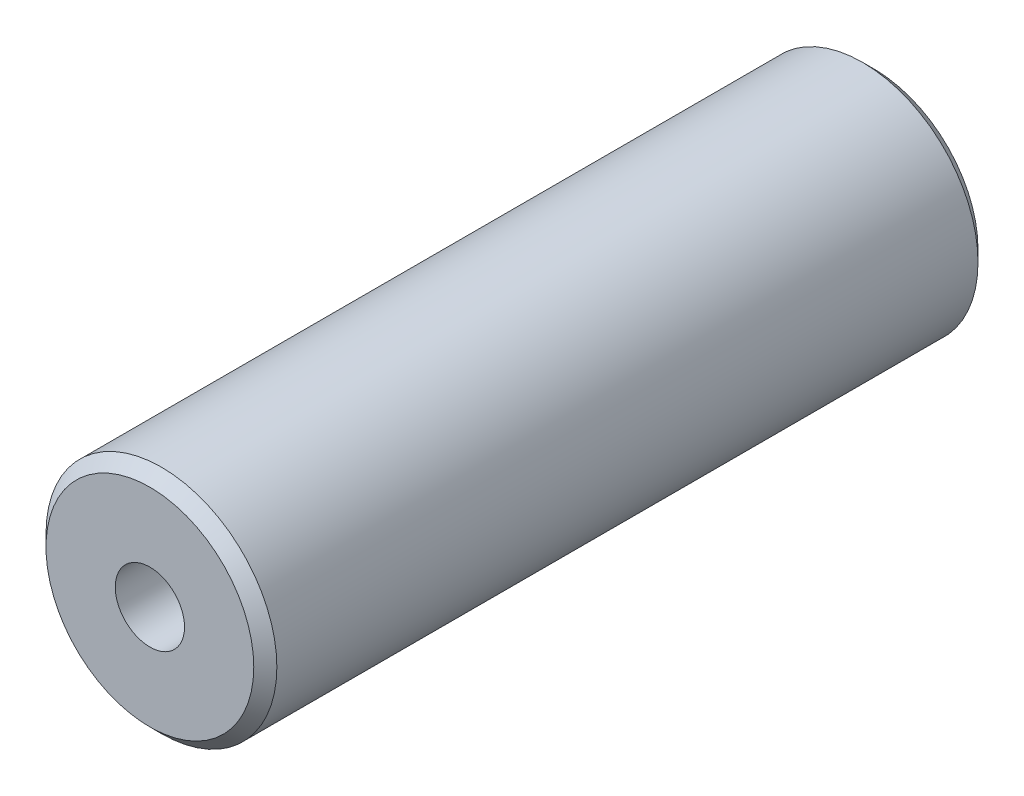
ISO-10303-21;
HEADER;
FILE_DESCRIPTION(('STEP AP214'),'2;1');
FILE_NAME('part.step','',(''),(''),'','','');
FILE_SCHEMA(('AUTOMOTIVE_DESIGN { 1 0 10303 214 1 1 1 1 }'));
ENDSEC;
DATA;
#1=APPLICATION_CONTEXT('core data for automotive mechanical design processes');
#2=APPLICATION_PROTOCOL_DEFINITION('international standard','automotive_design',2000,#1);
#3=PRODUCT_CONTEXT('',#1,'mechanical');
#4=PRODUCT('Part','Part','',(#3));
#5=PRODUCT_RELATED_PRODUCT_CATEGORY('part','',(#4));
#6=PRODUCT_DEFINITION_FORMATION('','',#4);
#7=PRODUCT_DEFINITION_CONTEXT('part definition',#1,'design');
#8=PRODUCT_DEFINITION('design','',#6,#7);
#9=PRODUCT_DEFINITION_SHAPE('','',#8);
#10=(LENGTH_UNIT() NAMED_UNIT(*) SI_UNIT(.MILLI.,.METRE.));
#11=(NAMED_UNIT(*) PLANE_ANGLE_UNIT() SI_UNIT($,.RADIAN.));
#12=(NAMED_UNIT(*) SI_UNIT($,.STERADIAN.) SOLID_ANGLE_UNIT());
#13=UNCERTAINTY_MEASURE_WITH_UNIT(LENGTH_MEASURE(1.E-05),#10,'distance_accuracy_value','');
#14=(GEOMETRIC_REPRESENTATION_CONTEXT(3) GLOBAL_UNCERTAINTY_ASSIGNED_CONTEXT((#13)) GLOBAL_UNIT_ASSIGNED_CONTEXT((#10,
#11,#12)) REPRESENTATION_CONTEXT('',''));
#15=CARTESIAN_POINT('',(0.,0.,0.));
#16=DIRECTION('',(0.,0.,1.));
#17=DIRECTION('',(1.,0.,0.));
#18=AXIS2_PLACEMENT_3D('',#15,#16,#17);
#19=CARTESIAN_POINT('',(0.,0.,62.74));
#20=DIRECTION('',(0.,0.,-1.));
#21=DIRECTION('',(-1.,0.,0.));
#22=AXIS2_PLACEMENT_3D('',#19,#20,#21);
#23=CYLINDRICAL_SURFACE('',#22,10.);
#24=CARTESIAN_POINT('',(0.,0.,1.00000000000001));
#25=DIRECTION('',(0.,0.,1.));
#26=DIRECTION('',(1.,0.,0.));
#27=AXIS2_PLACEMENT_3D('',#24,#25,#26);
#28=CIRCLE('',#27,10.);
#29=CARTESIAN_POINT('',(10.,0.,1.00000000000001));
#30=VERTEX_POINT('',#29);
#31=EDGE_CURVE('E41',#30,#30,#28,.T.);
#32=ORIENTED_EDGE('',*,*,#31,.T.);
#33=EDGE_LOOP('',(#32));
#34=FACE_BOUND('',#33,.T.);
#35=CARTESIAN_POINT('',(0.,0.,61.74));
#36=DIRECTION('',(0.,0.,1.));
#37=DIRECTION('',(1.,0.,0.));
#38=AXIS2_PLACEMENT_3D('',#35,#36,#37);
#39=CIRCLE('',#38,10.);
#40=CARTESIAN_POINT('',(10.,0.,61.74));
#41=VERTEX_POINT('',#40);
#42=EDGE_CURVE('E45',#41,#41,#39,.F.);
#43=ORIENTED_EDGE('',*,*,#42,.T.);
#44=EDGE_LOOP('',(#43));
#45=FACE_BOUND('',#44,.T.);
#46=ADVANCED_FACE('F30',(#34,#45),#23,.T.);
#47=CARTESIAN_POINT('',(0.,0.,62.74));
#48=DIRECTION('',(0.,0.,1.));
#49=DIRECTION('',(1.,0.,0.));
#50=AXIS2_PLACEMENT_3D('',#47,#48,#49);
#51=PLANE('',#50);
#52=CARTESIAN_POINT('',(0.,0.,62.74));
#53=DIRECTION('',(0.,0.,1.));
#54=DIRECTION('',(1.,0.,0.));
#55=AXIS2_PLACEMENT_3D('',#52,#53,#54);
#56=CIRCLE('',#55,3.);
#57=CARTESIAN_POINT('',(3.,0.,62.74));
#58=VERTEX_POINT('',#57);
#59=EDGE_CURVE('E51',#58,#58,#56,.T.);
#60=ORIENTED_EDGE('',*,*,#59,.F.);
#61=EDGE_LOOP('',(#60));
#62=FACE_BOUND('',#61,.T.);
#63=CARTESIAN_POINT('',(0.,0.,62.74));
#64=DIRECTION('',(0.,0.,1.));
#65=DIRECTION('',(1.,0.,0.));
#66=AXIS2_PLACEMENT_3D('',#63,#64,#65);
#67=CIRCLE('',#66,9.00000000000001);
#68=CARTESIAN_POINT('',(9.00000000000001,0.,62.74));
#69=VERTEX_POINT('',#68);
#70=EDGE_CURVE('E10',#69,#69,#67,.T.);
#71=ORIENTED_EDGE('',*,*,#70,.T.);
#72=EDGE_LOOP('',(#71));
#73=FACE_BOUND('',#72,.T.);
#74=ADVANCED_FACE('F75',(#62,#73),#51,.T.);
#75=CARTESIAN_POINT('',(0.,0.,0.));
#76=DIRECTION('',(0.,0.,1.));
#77=DIRECTION('',(1.,0.,0.));
#78=AXIS2_PLACEMENT_3D('',#75,#76,#77);
#79=PLANE('',#78);
#80=CARTESIAN_POINT('',(0.,0.,0.));
#81=DIRECTION('',(0.,0.,-1.));
#82=DIRECTION('',(-1.,0.,0.));
#83=AXIS2_PLACEMENT_3D('',#80,#81,#82);
#84=CIRCLE('',#83,3.);
#85=CARTESIAN_POINT('',(-3.,0.,0.));
#86=VERTEX_POINT('',#85);
#87=EDGE_CURVE('E57',#86,#86,#84,.T.);
#88=ORIENTED_EDGE('',*,*,#87,.F.);
#89=EDGE_LOOP('',(#88));
#90=FACE_BOUND('',#89,.T.);
#91=CARTESIAN_POINT('',(0.,0.,0.));
#92=DIRECTION('',(0.,0.,1.));
#93=DIRECTION('',(1.,0.,0.));
#94=AXIS2_PLACEMENT_3D('',#91,#92,#93);
#95=CIRCLE('',#94,8.99999999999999);
#96=CARTESIAN_POINT('',(8.99999999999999,0.,0.));
#97=VERTEX_POINT('',#96);
#98=EDGE_CURVE('E37',#97,#97,#95,.F.);
#99=ORIENTED_EDGE('',*,*,#98,.T.);
#100=EDGE_LOOP('',(#99));
#101=FACE_BOUND('',#100,.T.);
#102=ADVANCED_FACE('F72',(#90,#101),#79,.F.);
#103=CARTESIAN_POINT('',(0.,0.,1.00000000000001));
#104=DIRECTION('',(0.,0.,1.));
#105=DIRECTION('',(1.,0.,0.));
#106=AXIS2_PLACEMENT_3D('',#103,#104,#105);
#107=CONICAL_SURFACE('',#106,10.,0.785398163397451);
#108=ORIENTED_EDGE('',*,*,#98,.F.);
#109=EDGE_LOOP('',(#108));
#110=FACE_BOUND('',#109,.T.);
#111=ORIENTED_EDGE('',*,*,#31,.F.);
#112=EDGE_LOOP('',(#111));
#113=FACE_BOUND('',#112,.T.);
#114=ADVANCED_FACE('F74',(#110,#113),#107,.T.);
#115=CARTESIAN_POINT('',(0.,0.,62.74));
#116=DIRECTION('',(0.,0.,-1.));
#117=DIRECTION('',(-1.,0.,0.));
#118=AXIS2_PLACEMENT_3D('',#115,#116,#117);
#119=CONICAL_SURFACE('',#118,9.00000000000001,0.785398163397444);
#120=ORIENTED_EDGE('',*,*,#42,.F.);
#121=EDGE_LOOP('',(#120));
#122=FACE_BOUND('',#121,.T.);
#123=ORIENTED_EDGE('',*,*,#70,.F.);
#124=EDGE_LOOP('',(#123));
#125=FACE_BOUND('',#124,.T.);
#126=ADVANCED_FACE('F32',(#122,#125),#119,.T.);
#127=CARTESIAN_POINT('',(0.,0.,52.74));
#128=DIRECTION('',(0.,0.,1.));
#129=DIRECTION('',(1.,0.,0.));
#130=AXIS2_PLACEMENT_3D('',#127,#128,#129);
#131=CYLINDRICAL_SURFACE('',#130,3.);
#132=CARTESIAN_POINT('',(0.,0.,52.74));
#133=DIRECTION('',(0.,0.,1.));
#134=DIRECTION('',(1.,0.,0.));
#135=AXIS2_PLACEMENT_3D('',#132,#133,#134);
#136=CIRCLE('',#135,3.);
#137=CARTESIAN_POINT('',(3.,0.,52.74));
#138=VERTEX_POINT('',#137);
#139=EDGE_CURVE('E50',#138,#138,#136,.T.);
#140=ORIENTED_EDGE('',*,*,#139,.F.);
#141=EDGE_LOOP('',(#140));
#142=FACE_BOUND('',#141,.T.);
#143=ORIENTED_EDGE('',*,*,#59,.T.);
#144=EDGE_LOOP('',(#143));
#145=FACE_BOUND('',#144,.T.);
#146=ADVANCED_FACE('F95',(#142,#145),#131,.F.);
#147=CARTESIAN_POINT('',(0.,0.,52.74));
#148=DIRECTION('',(0.,0.,1.));
#149=DIRECTION('',(1.,0.,0.));
#150=AXIS2_PLACEMENT_3D('',#147,#148,#149);
#151=PLANE('',#150);
#152=ORIENTED_EDGE('',*,*,#139,.T.);
#153=EDGE_LOOP('',(#152));
#154=FACE_BOUND('',#153,.T.);
#155=ADVANCED_FACE('F68',(#154),#151,.T.);
#156=CARTESIAN_POINT('',(0.,0.,10.));
#157=DIRECTION('',(0.,0.,-1.));
#158=DIRECTION('',(-1.,0.,0.));
#159=AXIS2_PLACEMENT_3D('',#156,#157,#158);
#160=CYLINDRICAL_SURFACE('',#159,3.);
#161=CARTESIAN_POINT('',(0.,0.,10.));
#162=DIRECTION('',(0.,0.,-1.));
#163=DIRECTION('',(-1.,0.,0.));
#164=AXIS2_PLACEMENT_3D('',#161,#162,#163);
#165=CIRCLE('',#164,3.);
#166=CARTESIAN_POINT('',(-3.,0.,10.));
#167=VERTEX_POINT('',#166);
#168=EDGE_CURVE('E54',#167,#167,#165,.T.);
#169=ORIENTED_EDGE('',*,*,#168,.F.);
#170=EDGE_LOOP('',(#169));
#171=FACE_BOUND('',#170,.T.);
#172=ORIENTED_EDGE('',*,*,#87,.T.);
#173=EDGE_LOOP('',(#172));
#174=FACE_BOUND('',#173,.T.);
#175=ADVANCED_FACE('F65',(#171,#174),#160,.F.);
#176=CARTESIAN_POINT('',(0.,0.,10.));
#177=DIRECTION('',(0.,0.,-1.));
#178=DIRECTION('',(-1.,0.,0.));
#179=AXIS2_PLACEMENT_3D('',#176,#177,#178);
#180=PLANE('',#179);
#181=ORIENTED_EDGE('',*,*,#168,.T.);
#182=EDGE_LOOP('',(#181));
#183=FACE_BOUND('',#182,.T.);
#184=ADVANCED_FACE('F63',(#183),#180,.T.);
#185=CLOSED_SHELL('',(#46,#74,#102,#114,#126,#146,#155,#175,#184));
#186=MANIFOLD_SOLID_BREP('B2',#185);
#187=ADVANCED_BREP_SHAPE_REPRESENTATION('',(#18,#186),#14);
#188=SHAPE_DEFINITION_REPRESENTATION(#9,#187);
ENDSEC;
END-ISO-10303-21;
